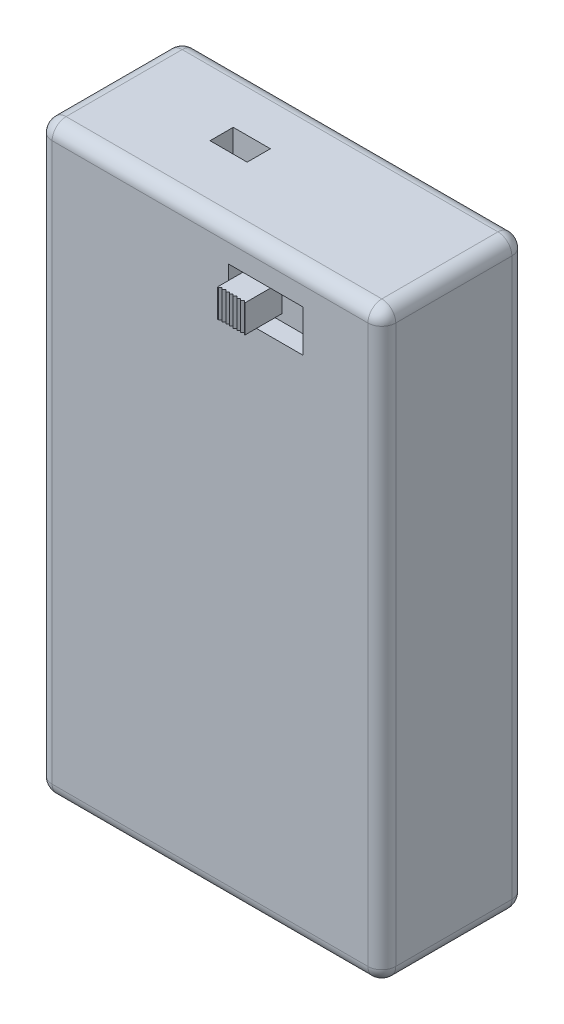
ISO-10303-21;
HEADER;
FILE_DESCRIPTION(('STEP AP214'),'2;1');
FILE_NAME('part.step','',(''),(''),'','','');
FILE_SCHEMA(('AUTOMOTIVE_DESIGN { 1 0 10303 214 1 1 1 1 }'));
ENDSEC;
DATA;
#1=APPLICATION_CONTEXT('core data for automotive mechanical design processes');
#2=APPLICATION_PROTOCOL_DEFINITION('international standard','automotive_design',2000,#1);
#3=PRODUCT_CONTEXT('',#1,'mechanical');
#4=PRODUCT('Part','Part','',(#3));
#5=PRODUCT_RELATED_PRODUCT_CATEGORY('part','',(#4));
#6=PRODUCT_DEFINITION_FORMATION('','',#4);
#7=PRODUCT_DEFINITION_CONTEXT('part definition',#1,'design');
#8=PRODUCT_DEFINITION('design','',#6,#7);
#9=PRODUCT_DEFINITION_SHAPE('','',#8);
#10=(LENGTH_UNIT() NAMED_UNIT(*) SI_UNIT(.MILLI.,.METRE.));
#11=(NAMED_UNIT(*) PLANE_ANGLE_UNIT() SI_UNIT($,.RADIAN.));
#12=(NAMED_UNIT(*) SI_UNIT($,.STERADIAN.) SOLID_ANGLE_UNIT());
#13=UNCERTAINTY_MEASURE_WITH_UNIT(LENGTH_MEASURE(1.E-05),#10,'distance_accuracy_value','');
#14=(GEOMETRIC_REPRESENTATION_CONTEXT(3) GLOBAL_UNCERTAINTY_ASSIGNED_CONTEXT((#13)) GLOBAL_UNIT_ASSIGNED_CONTEXT((#10,
#11,#12)) REPRESENTATION_CONTEXT('',''));
#15=CARTESIAN_POINT('',(0.,0.,0.));
#16=DIRECTION('',(0.,0.,1.));
#17=DIRECTION('',(1.,0.,0.));
#18=AXIS2_PLACEMENT_3D('',#15,#16,#17);
#19=CARTESIAN_POINT('',(21.2846397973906,55.75,17.5));
#20=DIRECTION('',(0.,1.,0.));
#21=DIRECTION('',(0.,0.,1.));
#22=AXIS2_PLACEMENT_3D('',#19,#20,#21);
#23=PLANE('',#22);
#24=DIRECTION('',(0.707106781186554,0.,0.707106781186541));
#25=VECTOR('',#24,1.);
#26=CARTESIAN_POINT('',(22.7403150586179,55.75,16.0443247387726));
#27=LINE('',#26,#25);
#28=CARTESIAN_POINT('',(23.9959903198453,55.75,17.3));
#29=VERTEX_POINT('',#28);
#30=CARTESIAN_POINT('',(24.1959903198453,55.75,17.5));
#31=VERTEX_POINT('',#30);
#32=EDGE_CURVE('E419',#29,#31,#27,.T.);
#33=ORIENTED_EDGE('',*,*,#32,.F.);
#34=DIRECTION('',(0.707106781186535,0.,-0.70710678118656));
#35=VECTOR('',#34,1.);
#36=CARTESIAN_POINT('',(22.540315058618,55.75,18.7556752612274));
#37=LINE('',#36,#35);
#38=CARTESIAN_POINT('',(23.7959903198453,55.75,17.5));
#39=VERTEX_POINT('',#38);
#40=EDGE_CURVE('E415',#39,#29,#37,.T.);
#41=ORIENTED_EDGE('',*,*,#40,.F.);
#42=DIRECTION('',(0.707106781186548,0.,0.707106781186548));
#43=VECTOR('',#42,1.);
#44=CARTESIAN_POINT('',(22.540315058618,55.75,16.2443247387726));
#45=LINE('',#44,#43);
#46=CARTESIAN_POINT('',(23.5959903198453,55.75,17.3));
#47=VERTEX_POINT('',#46);
#48=EDGE_CURVE('E411',#47,#39,#45,.T.);
#49=ORIENTED_EDGE('',*,*,#48,.F.);
#50=DIRECTION('',(0.707106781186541,0.,-0.707106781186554));
#51=VECTOR('',#50,1.);
#52=CARTESIAN_POINT('',(22.340315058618,55.75,18.5556752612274));
#53=LINE('',#52,#51);
#54=CARTESIAN_POINT('',(23.3959903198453,55.75,17.5));
#55=VERTEX_POINT('',#54);
#56=EDGE_CURVE('E407',#55,#47,#53,.T.);
#57=ORIENTED_EDGE('',*,*,#56,.F.);
#58=DIRECTION('',(0.707106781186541,0.,0.707106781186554));
#59=VECTOR('',#58,1.);
#60=CARTESIAN_POINT('',(22.340315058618,55.75,16.4443247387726));
#61=LINE('',#60,#59);
#62=CARTESIAN_POINT('',(23.1959903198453,55.75,17.3));
#63=VERTEX_POINT('',#62);
#64=EDGE_CURVE('E403',#63,#55,#61,.T.);
#65=ORIENTED_EDGE('',*,*,#64,.F.);
#66=DIRECTION('',(0.707106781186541,0.,-0.707106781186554));
#67=VECTOR('',#66,1.);
#68=CARTESIAN_POINT('',(22.140315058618,55.75,18.3556752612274));
#69=LINE('',#68,#67);
#70=CARTESIAN_POINT('',(22.9959903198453,55.75,17.5));
#71=VERTEX_POINT('',#70);
#72=EDGE_CURVE('E399',#71,#63,#69,.T.);
#73=ORIENTED_EDGE('',*,*,#72,.F.);
#74=DIRECTION('',(0.707106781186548,0.,0.707106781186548));
#75=VECTOR('',#74,1.);
#76=CARTESIAN_POINT('',(22.140315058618,55.75,16.6443247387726));
#77=LINE('',#76,#75);
#78=CARTESIAN_POINT('',(22.7959903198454,55.75,17.3));
#79=VERTEX_POINT('',#78);
#80=EDGE_CURVE('E395',#79,#71,#77,.T.);
#81=ORIENTED_EDGE('',*,*,#80,.F.);
#82=DIRECTION('',(0.707106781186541,0.,-0.707106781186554));
#83=VECTOR('',#82,1.);
#84=CARTESIAN_POINT('',(21.940315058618,55.75,18.1556752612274));
#85=LINE('',#84,#83);
#86=CARTESIAN_POINT('',(22.5959903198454,55.75,17.5));
#87=VERTEX_POINT('',#86);
#88=EDGE_CURVE('E391',#87,#79,#85,.T.);
#89=ORIENTED_EDGE('',*,*,#88,.F.);
#90=DIRECTION('',(0.70710678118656,0.,0.707106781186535));
#91=VECTOR('',#90,1.);
#92=CARTESIAN_POINT('',(21.940315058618,55.75,16.8443247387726));
#93=LINE('',#92,#91);
#94=CARTESIAN_POINT('',(22.3959903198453,55.75,17.3));
#95=VERTEX_POINT('',#94);
#96=EDGE_CURVE('E387',#95,#87,#93,.T.);
#97=ORIENTED_EDGE('',*,*,#96,.F.);
#98=DIRECTION('',(0.707106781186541,0.,-0.707106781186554));
#99=VECTOR('',#98,1.);
#100=CARTESIAN_POINT('',(21.740315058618,55.75,17.9556752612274));
#101=LINE('',#100,#99);
#102=CARTESIAN_POINT('',(22.1959903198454,55.75,17.5));
#103=VERTEX_POINT('',#102);
#104=EDGE_CURVE('E383',#103,#95,#101,.T.);
#105=ORIENTED_EDGE('',*,*,#104,.F.);
#106=DIRECTION('',(0.707106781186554,0.,0.707106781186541));
#107=VECTOR('',#106,1.);
#108=CARTESIAN_POINT('',(21.740315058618,55.75,17.0443247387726));
#109=LINE('',#108,#107);
#110=CARTESIAN_POINT('',(21.9959903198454,55.75,17.3));
#111=VERTEX_POINT('',#110);
#112=EDGE_CURVE('E379',#111,#103,#109,.T.);
#113=ORIENTED_EDGE('',*,*,#112,.F.);
#114=DIRECTION('',(0.707106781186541,0.,-0.707106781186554));
#115=VECTOR('',#114,1.);
#116=CARTESIAN_POINT('',(21.540315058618,55.75,17.7556752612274));
#117=LINE('',#116,#115);
#118=CARTESIAN_POINT('',(21.7959903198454,55.75,17.5));
#119=VERTEX_POINT('',#118);
#120=EDGE_CURVE('E375',#119,#111,#117,.T.);
#121=ORIENTED_EDGE('',*,*,#120,.F.);
#122=DIRECTION('',(0.707106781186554,0.,0.707106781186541));
#123=VECTOR('',#122,1.);
#124=CARTESIAN_POINT('',(21.540315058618,55.75,17.2443247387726));
#125=LINE('',#124,#123);
#126=CARTESIAN_POINT('',(21.5959903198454,55.75,17.3));
#127=VERTEX_POINT('',#126);
#128=EDGE_CURVE('E371',#127,#119,#125,.T.);
#129=ORIENTED_EDGE('',*,*,#128,.F.);
#130=DIRECTION('',(0.707106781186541,0.,-0.707106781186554));
#131=VECTOR('',#130,1.);
#132=CARTESIAN_POINT('',(21.340315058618,55.75,17.5556752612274));
#133=LINE('',#132,#131);
#134=CARTESIAN_POINT('',(21.3959903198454,55.75,17.5));
#135=VERTEX_POINT('',#134);
#136=EDGE_CURVE('E367',#135,#127,#133,.T.);
#137=ORIENTED_EDGE('',*,*,#136,.F.);
#138=DIRECTION('',(1.,0.,0.));
#139=VECTOR('',#138,1.);
#140=CARTESIAN_POINT('',(21.2846397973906,55.75,17.5));
#141=LINE('',#140,#139);
#142=CARTESIAN_POINT('',(21.2846397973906,55.75,17.5));
#143=VERTEX_POINT('',#142);
#144=EDGE_CURVE('E427',#143,#135,#141,.T.);
#145=ORIENTED_EDGE('',*,*,#144,.F.);
#146=DIRECTION('',(0.,0.,-1.));
#147=VECTOR('',#146,1.);
#148=CARTESIAN_POINT('',(21.2846397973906,55.75,17.5));
#149=LINE('',#148,#147);
#150=CARTESIAN_POINT('',(21.2846397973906,55.75,13.5));
#151=VERTEX_POINT('',#150);
#152=EDGE_CURVE('E452',#143,#151,#149,.T.);
#153=ORIENTED_EDGE('',*,*,#152,.T.);
#154=DIRECTION('',(1.,0.,0.));
#155=VECTOR('',#154,1.);
#156=CARTESIAN_POINT('',(21.2846397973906,55.75,13.5));
#157=LINE('',#156,#155);
#158=CARTESIAN_POINT('',(24.25,55.75,13.5));
#159=VERTEX_POINT('',#158);
#160=EDGE_CURVE('E439',#151,#159,#157,.T.);
#161=ORIENTED_EDGE('',*,*,#160,.T.);
#162=DIRECTION('',(0.,0.,-1.));
#163=VECTOR('',#162,1.);
#164=CARTESIAN_POINT('',(24.25,55.75,17.5));
#165=LINE('',#164,#163);
#166=CARTESIAN_POINT('',(24.25,55.75,17.5));
#167=VERTEX_POINT('',#166);
#168=EDGE_CURVE('E449',#167,#159,#165,.T.);
#169=ORIENTED_EDGE('',*,*,#168,.F.);
#170=EDGE_CURVE('E425',#31,#167,#141,.T.);
#171=ORIENTED_EDGE('',*,*,#170,.F.);
#172=EDGE_LOOP('',(#33,#41,#49,#57,#65,#73,#81,#89,#97,#105,#113,#121,#129,#137,#145,#153,#161,
#169,#171));
#173=FACE_BOUND('',#172,.T.);
#174=ADVANCED_FACE('F37',(#173),#23,.F.);
#175=CARTESIAN_POINT('',(21.2846397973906,58.75,17.5));
#176=DIRECTION('',(0.,-1.,0.));
#177=DIRECTION('',(0.,0.,-1.));
#178=AXIS2_PLACEMENT_3D('',#175,#176,#177);
#179=PLANE('',#178);
#180=DIRECTION('',(-0.707106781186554,0.,-0.707106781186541));
#181=VECTOR('',#180,1.);
#182=CARTESIAN_POINT('',(22.7403150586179,58.75,16.0443247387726));
#183=LINE('',#182,#181);
#184=CARTESIAN_POINT('',(24.1959903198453,58.75,17.5));
#185=VERTEX_POINT('',#184);
#186=CARTESIAN_POINT('',(23.9959903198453,58.75,17.3));
#187=VERTEX_POINT('',#186);
#188=EDGE_CURVE('E417',#185,#187,#183,.T.);
#189=ORIENTED_EDGE('',*,*,#188,.F.);
#190=DIRECTION('',(-1.,0.,0.));
#191=VECTOR('',#190,1.);
#192=CARTESIAN_POINT('',(21.2846397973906,58.75,17.5));
#193=LINE('',#192,#191);
#194=CARTESIAN_POINT('',(24.25,58.75,17.5));
#195=VERTEX_POINT('',#194);
#196=EDGE_CURVE('E433',#195,#185,#193,.T.);
#197=ORIENTED_EDGE('',*,*,#196,.F.);
#198=DIRECTION('',(0.,0.,-1.));
#199=VECTOR('',#198,1.);
#200=CARTESIAN_POINT('',(24.25,58.75,17.5));
#201=LINE('',#200,#199);
#202=CARTESIAN_POINT('',(24.25,58.75,13.5));
#203=VERTEX_POINT('',#202);
#204=EDGE_CURVE('E447',#195,#203,#201,.T.);
#205=ORIENTED_EDGE('',*,*,#204,.T.);
#206=DIRECTION('',(-1.,0.,0.));
#207=VECTOR('',#206,1.);
#208=CARTESIAN_POINT('',(21.2846397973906,58.75,13.5));
#209=LINE('',#208,#207);
#210=CARTESIAN_POINT('',(21.2846397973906,58.75,13.5));
#211=VERTEX_POINT('',#210);
#212=EDGE_CURVE('E426',#203,#211,#209,.T.);
#213=ORIENTED_EDGE('',*,*,#212,.T.);
#214=DIRECTION('',(0.,0.,-1.));
#215=VECTOR('',#214,1.);
#216=CARTESIAN_POINT('',(21.2846397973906,58.75,17.5));
#217=LINE('',#216,#215);
#218=CARTESIAN_POINT('',(21.2846397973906,58.75,17.5));
#219=VERTEX_POINT('',#218);
#220=EDGE_CURVE('E436',#219,#211,#217,.T.);
#221=ORIENTED_EDGE('',*,*,#220,.F.);
#222=CARTESIAN_POINT('',(21.3959903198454,58.75,17.5));
#223=VERTEX_POINT('',#222);
#224=EDGE_CURVE('E432',#223,#219,#193,.T.);
#225=ORIENTED_EDGE('',*,*,#224,.F.);
#226=DIRECTION('',(-0.707106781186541,0.,0.707106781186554));
#227=VECTOR('',#226,1.);
#228=CARTESIAN_POINT('',(21.340315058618,58.75,17.5556752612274));
#229=LINE('',#228,#227);
#230=CARTESIAN_POINT('',(21.5959903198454,58.75,17.3));
#231=VERTEX_POINT('',#230);
#232=EDGE_CURVE('E60',#231,#223,#229,.T.);
#233=ORIENTED_EDGE('',*,*,#232,.F.);
#234=DIRECTION('',(-0.707106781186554,0.,-0.707106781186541));
#235=VECTOR('',#234,1.);
#236=CARTESIAN_POINT('',(21.540315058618,58.75,17.2443247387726));
#237=LINE('',#236,#235);
#238=CARTESIAN_POINT('',(21.7959903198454,58.75,17.5));
#239=VERTEX_POINT('',#238);
#240=EDGE_CURVE('E369',#239,#231,#237,.T.);
#241=ORIENTED_EDGE('',*,*,#240,.F.);
#242=DIRECTION('',(-0.707106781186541,0.,0.707106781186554));
#243=VECTOR('',#242,1.);
#244=CARTESIAN_POINT('',(21.540315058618,58.75,17.7556752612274));
#245=LINE('',#244,#243);
#246=CARTESIAN_POINT('',(21.9959903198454,58.75,17.3));
#247=VERTEX_POINT('',#246);
#248=EDGE_CURVE('E373',#247,#239,#245,.T.);
#249=ORIENTED_EDGE('',*,*,#248,.F.);
#250=DIRECTION('',(-0.707106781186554,0.,-0.707106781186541));
#251=VECTOR('',#250,1.);
#252=CARTESIAN_POINT('',(21.740315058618,58.75,17.0443247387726));
#253=LINE('',#252,#251);
#254=CARTESIAN_POINT('',(22.1959903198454,58.75,17.5));
#255=VERTEX_POINT('',#254);
#256=EDGE_CURVE('E377',#255,#247,#253,.T.);
#257=ORIENTED_EDGE('',*,*,#256,.F.);
#258=DIRECTION('',(-0.707106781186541,0.,0.707106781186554));
#259=VECTOR('',#258,1.);
#260=CARTESIAN_POINT('',(21.740315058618,58.75,17.9556752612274));
#261=LINE('',#260,#259);
#262=CARTESIAN_POINT('',(22.3959903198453,58.75,17.3));
#263=VERTEX_POINT('',#262);
#264=EDGE_CURVE('E381',#263,#255,#261,.T.);
#265=ORIENTED_EDGE('',*,*,#264,.F.);
#266=DIRECTION('',(-0.70710678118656,0.,-0.707106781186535));
#267=VECTOR('',#266,1.);
#268=CARTESIAN_POINT('',(21.940315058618,58.75,16.8443247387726));
#269=LINE('',#268,#267);
#270=CARTESIAN_POINT('',(22.5959903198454,58.75,17.5));
#271=VERTEX_POINT('',#270);
#272=EDGE_CURVE('E385',#271,#263,#269,.T.);
#273=ORIENTED_EDGE('',*,*,#272,.F.);
#274=DIRECTION('',(-0.707106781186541,0.,0.707106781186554));
#275=VECTOR('',#274,1.);
#276=CARTESIAN_POINT('',(21.940315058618,58.75,18.1556752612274));
#277=LINE('',#276,#275);
#278=CARTESIAN_POINT('',(22.7959903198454,58.75,17.3));
#279=VERTEX_POINT('',#278);
#280=EDGE_CURVE('E389',#279,#271,#277,.T.);
#281=ORIENTED_EDGE('',*,*,#280,.F.);
#282=DIRECTION('',(-0.707106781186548,0.,-0.707106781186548));
#283=VECTOR('',#282,1.);
#284=CARTESIAN_POINT('',(22.140315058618,58.75,16.6443247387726));
#285=LINE('',#284,#283);
#286=CARTESIAN_POINT('',(22.9959903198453,58.75,17.5));
#287=VERTEX_POINT('',#286);
#288=EDGE_CURVE('E393',#287,#279,#285,.T.);
#289=ORIENTED_EDGE('',*,*,#288,.F.);
#290=DIRECTION('',(-0.707106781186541,0.,0.707106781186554));
#291=VECTOR('',#290,1.);
#292=CARTESIAN_POINT('',(22.140315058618,58.75,18.3556752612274));
#293=LINE('',#292,#291);
#294=CARTESIAN_POINT('',(23.1959903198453,58.75,17.3));
#295=VERTEX_POINT('',#294);
#296=EDGE_CURVE('E397',#295,#287,#293,.T.);
#297=ORIENTED_EDGE('',*,*,#296,.F.);
#298=DIRECTION('',(-0.707106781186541,0.,-0.707106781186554));
#299=VECTOR('',#298,1.);
#300=CARTESIAN_POINT('',(22.340315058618,58.75,16.4443247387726));
#301=LINE('',#300,#299);
#302=CARTESIAN_POINT('',(23.3959903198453,58.75,17.5));
#303=VERTEX_POINT('',#302);
#304=EDGE_CURVE('E401',#303,#295,#301,.T.);
#305=ORIENTED_EDGE('',*,*,#304,.F.);
#306=DIRECTION('',(-0.707106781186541,0.,0.707106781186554));
#307=VECTOR('',#306,1.);
#308=CARTESIAN_POINT('',(22.340315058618,58.75,18.5556752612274));
#309=LINE('',#308,#307);
#310=CARTESIAN_POINT('',(23.5959903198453,58.75,17.3));
#311=VERTEX_POINT('',#310);
#312=EDGE_CURVE('E405',#311,#303,#309,.T.);
#313=ORIENTED_EDGE('',*,*,#312,.F.);
#314=DIRECTION('',(-0.707106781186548,0.,-0.707106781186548));
#315=VECTOR('',#314,1.);
#316=CARTESIAN_POINT('',(22.540315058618,58.75,16.2443247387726));
#317=LINE('',#316,#315);
#318=CARTESIAN_POINT('',(23.7959903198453,58.75,17.5));
#319=VERTEX_POINT('',#318);
#320=EDGE_CURVE('E409',#319,#311,#317,.T.);
#321=ORIENTED_EDGE('',*,*,#320,.F.);
#322=DIRECTION('',(-0.707106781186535,0.,0.70710678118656));
#323=VECTOR('',#322,1.);
#324=CARTESIAN_POINT('',(22.540315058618,58.75,18.7556752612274));
#325=LINE('',#324,#323);
#326=EDGE_CURVE('E413',#187,#319,#325,.T.);
#327=ORIENTED_EDGE('',*,*,#326,.F.);
#328=EDGE_LOOP('',(#189,#197,#205,#213,#221,#225,#233,#241,#249,#257,#265,#273,#281,#289,#297,
#305,#313,#321,#327));
#329=FACE_BOUND('',#328,.T.);
#330=ADVANCED_FACE('F614',(#329),#179,.F.);
#331=CARTESIAN_POINT('',(0.,0.,17.5));
#332=DIRECTION('',(0.,0.,1.));
#333=DIRECTION('',(1.,0.,0.));
#334=AXIS2_PLACEMENT_3D('',#331,#332,#333);
#335=PLANE('',#334);
#336=ORIENTED_EDGE('',*,*,#196,.T.);
#337=DIRECTION('',(0.,-1.,0.));
#338=VECTOR('',#337,1.);
#339=CARTESIAN_POINT('',(24.1959903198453,0.,17.5));
#340=LINE('',#339,#338);
#341=EDGE_CURVE('E11',#185,#31,#340,.T.);
#342=ORIENTED_EDGE('',*,*,#341,.T.);
#343=ORIENTED_EDGE('',*,*,#170,.T.);
#344=DIRECTION('',(0.,1.,0.));
#345=VECTOR('',#344,1.);
#346=CARTESIAN_POINT('',(24.25,58.75,17.5));
#347=LINE('',#346,#345);
#348=EDGE_CURVE('E430',#167,#195,#347,.T.);
#349=ORIENTED_EDGE('',*,*,#348,.T.);
#350=EDGE_LOOP('',(#336,#342,#343,#349));
#351=FACE_BOUND('',#350,.T.);
#352=ADVANCED_FACE('F691',(#351),#335,.T.);
#353=ORIENTED_EDGE('',*,*,#144,.T.);
#354=DIRECTION('',(0.,1.,0.));
#355=VECTOR('',#354,1.);
#356=CARTESIAN_POINT('',(21.3959903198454,0.,17.5));
#357=LINE('',#356,#355);
#358=EDGE_CURVE('E45',#135,#223,#357,.T.);
#359=ORIENTED_EDGE('',*,*,#358,.T.);
#360=ORIENTED_EDGE('',*,*,#224,.T.);
#361=DIRECTION('',(0.,-1.,0.));
#362=VECTOR('',#361,1.);
#363=CARTESIAN_POINT('',(21.2846397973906,58.75,17.5));
#364=LINE('',#363,#362);
#365=EDGE_CURVE('E422',#219,#143,#364,.T.);
#366=ORIENTED_EDGE('',*,*,#365,.T.);
#367=EDGE_LOOP('',(#353,#359,#360,#366));
#368=FACE_BOUND('',#367,.T.);
#369=ADVANCED_FACE('F609',(#368),#335,.T.);
#370=CARTESIAN_POINT('',(0.,0.,13.5));
#371=DIRECTION('',(0.,0.,1.));
#372=DIRECTION('',(1.,0.,0.));
#373=AXIS2_PLACEMENT_3D('',#370,#371,#372);
#374=PLANE('',#373);
#375=DIRECTION('',(0.,-1.,0.));
#376=VECTOR('',#375,1.);
#377=CARTESIAN_POINT('',(20.5,59.5,13.5));
#378=LINE('',#377,#376);
#379=CARTESIAN_POINT('',(20.5,59.5,13.5));
#380=VERTEX_POINT('',#379);
#381=CARTESIAN_POINT('',(20.5,55.,13.5));
#382=VERTEX_POINT('',#381);
#383=EDGE_CURVE('E455',#380,#382,#378,.T.);
#384=ORIENTED_EDGE('',*,*,#383,.T.);
#385=DIRECTION('',(1.,0.,0.));
#386=VECTOR('',#385,1.);
#387=CARTESIAN_POINT('',(20.5,55.,13.5));
#388=LINE('',#387,#386);
#389=CARTESIAN_POINT('',(28.5,55.,13.5));
#390=VERTEX_POINT('',#389);
#391=EDGE_CURVE('E458',#382,#390,#388,.T.);
#392=ORIENTED_EDGE('',*,*,#391,.T.);
#393=DIRECTION('',(0.,1.,0.));
#394=VECTOR('',#393,1.);
#395=CARTESIAN_POINT('',(28.5,59.5,13.5));
#396=LINE('',#395,#394);
#397=CARTESIAN_POINT('',(28.5,59.5,13.5));
#398=VERTEX_POINT('',#397);
#399=EDGE_CURVE('E462',#390,#398,#396,.T.);
#400=ORIENTED_EDGE('',*,*,#399,.T.);
#401=DIRECTION('',(-1.,0.,0.));
#402=VECTOR('',#401,1.);
#403=CARTESIAN_POINT('',(20.5,59.5,13.5));
#404=LINE('',#403,#402);
#405=EDGE_CURVE('E465',#398,#380,#404,.T.);
#406=ORIENTED_EDGE('',*,*,#405,.T.);
#407=EDGE_LOOP('',(#384,#392,#400,#406));
#408=FACE_BOUND('',#407,.T.);
#409=ORIENTED_EDGE('',*,*,#160,.F.);
#410=DIRECTION('',(0.,-1.,0.));
#411=VECTOR('',#410,1.);
#412=CARTESIAN_POINT('',(21.2846397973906,58.75,13.5));
#413=LINE('',#412,#411);
#414=EDGE_CURVE('E421',#211,#151,#413,.T.);
#415=ORIENTED_EDGE('',*,*,#414,.F.);
#416=ORIENTED_EDGE('',*,*,#212,.F.);
#417=DIRECTION('',(0.,1.,0.));
#418=VECTOR('',#417,1.);
#419=CARTESIAN_POINT('',(24.25,58.75,13.5));
#420=LINE('',#419,#418);
#421=EDGE_CURVE('E441',#159,#203,#420,.T.);
#422=ORIENTED_EDGE('',*,*,#421,.F.);
#423=EDGE_LOOP('',(#409,#415,#416,#422));
#424=FACE_BOUND('',#423,.T.);
#425=ADVANCED_FACE('F698',(#408,#424),#374,.T.);
#426=CARTESIAN_POINT('',(0.,0.,15.5));
#427=DIRECTION('',(1.,0.,0.));
#428=DIRECTION('',(0.,0.,-1.));
#429=AXIS2_PLACEMENT_3D('',#426,#427,#428);
#430=PLANE('',#429);
#431=DIRECTION('',(0.,0.,-1.));
#432=VECTOR('',#431,1.);
#433=CARTESIAN_POINT('',(0.,61.5,15.5));
#434=LINE('',#433,#432);
#435=CARTESIAN_POINT('',(0.,61.5,14.));
#436=VERTEX_POINT('',#435);
#437=CARTESIAN_POINT('',(0.,61.5,1.5));
#438=VERTEX_POINT('',#437);
#439=EDGE_CURVE('E499',#436,#438,#434,.T.);
#440=ORIENTED_EDGE('',*,*,#439,.T.);
#441=DIRECTION('',(0.,-1.,0.));
#442=VECTOR('',#441,1.);
#443=CARTESIAN_POINT('',(0.,0.,1.5));
#444=LINE('',#443,#442);
#445=CARTESIAN_POINT('',(0.,1.5,1.5));
#446=VERTEX_POINT('',#445);
#447=EDGE_CURVE('E504',#438,#446,#444,.T.);
#448=ORIENTED_EDGE('',*,*,#447,.T.);
#449=DIRECTION('',(0.,0.,-1.));
#450=VECTOR('',#449,1.);
#451=CARTESIAN_POINT('',(0.,1.5,15.5));
#452=LINE('',#451,#450);
#453=CARTESIAN_POINT('',(0.,1.5,14.));
#454=VERTEX_POINT('',#453);
#455=EDGE_CURVE('E501',#446,#454,#452,.F.);
#456=ORIENTED_EDGE('',*,*,#455,.T.);
#457=DIRECTION('',(0.,-1.,0.));
#458=VECTOR('',#457,1.);
#459=CARTESIAN_POINT('',(0.,0.,14.));
#460=LINE('',#459,#458);
#461=EDGE_CURVE('E497',#454,#436,#460,.F.);
#462=ORIENTED_EDGE('',*,*,#461,.T.);
#463=EDGE_LOOP('',(#440,#448,#456,#462));
#464=FACE_BOUND('',#463,.T.);
#465=ADVANCED_FACE('F700',(#464),#430,.F.);
#466=CARTESIAN_POINT('',(0.,0.,15.5));
#467=DIRECTION('',(0.,1.,0.));
#468=DIRECTION('',(0.,0.,1.));
#469=AXIS2_PLACEMENT_3D('',#466,#467,#468);
#470=PLANE('',#469);
#471=DIRECTION('',(0.,0.,-1.));
#472=VECTOR('',#471,1.);
#473=CARTESIAN_POINT('',(1.5,0.,15.5));
#474=LINE('',#473,#472);
#475=CARTESIAN_POINT('',(1.5,0.,14.));
#476=VERTEX_POINT('',#475);
#477=CARTESIAN_POINT('',(1.5,0.,1.5));
#478=VERTEX_POINT('',#477);
#479=EDGE_CURVE('E492',#476,#478,#474,.T.);
#480=ORIENTED_EDGE('',*,*,#479,.T.);
#481=DIRECTION('',(1.,0.,0.));
#482=VECTOR('',#481,1.);
#483=CARTESIAN_POINT('',(37.,0.,1.5));
#484=LINE('',#483,#482);
#485=CARTESIAN_POINT('',(35.5,0.,1.5));
#486=VERTEX_POINT('',#485);
#487=EDGE_CURVE('E495',#478,#486,#484,.T.);
#488=ORIENTED_EDGE('',*,*,#487,.T.);
#489=DIRECTION('',(0.,0.,-1.));
#490=VECTOR('',#489,1.);
#491=CARTESIAN_POINT('',(35.5,0.,15.5));
#492=LINE('',#491,#490);
#493=CARTESIAN_POINT('',(35.5,0.,14.));
#494=VERTEX_POINT('',#493);
#495=EDGE_CURVE('E489',#486,#494,#492,.F.);
#496=ORIENTED_EDGE('',*,*,#495,.T.);
#497=DIRECTION('',(1.,0.,0.));
#498=VECTOR('',#497,1.);
#499=CARTESIAN_POINT('',(0.,0.,14.));
#500=LINE('',#499,#498);
#501=EDGE_CURVE('E487',#494,#476,#500,.F.);
#502=ORIENTED_EDGE('',*,*,#501,.T.);
#503=EDGE_LOOP('',(#480,#488,#496,#502));
#504=FACE_BOUND('',#503,.T.);
#505=ADVANCED_FACE('F707',(#504),#470,.F.);
#506=CARTESIAN_POINT('',(37.,0.,15.5));
#507=DIRECTION('',(-1.,0.,0.));
#508=DIRECTION('',(0.,0.,1.));
#509=AXIS2_PLACEMENT_3D('',#506,#507,#508);
#510=PLANE('',#509);
#511=DIRECTION('',(0.,0.,-1.));
#512=VECTOR('',#511,1.);
#513=CARTESIAN_POINT('',(37.,1.5,15.5));
#514=LINE('',#513,#512);
#515=CARTESIAN_POINT('',(37.,1.5,14.));
#516=VERTEX_POINT('',#515);
#517=CARTESIAN_POINT('',(37.,1.5,1.5));
#518=VERTEX_POINT('',#517);
#519=EDGE_CURVE('E510',#516,#518,#514,.T.);
#520=ORIENTED_EDGE('',*,*,#519,.T.);
#521=DIRECTION('',(0.,1.,0.));
#522=VECTOR('',#521,1.);
#523=CARTESIAN_POINT('',(37.,63.,1.5));
#524=LINE('',#523,#522);
#525=CARTESIAN_POINT('',(37.,61.5,1.5));
#526=VERTEX_POINT('',#525);
#527=EDGE_CURVE('E513',#518,#526,#524,.T.);
#528=ORIENTED_EDGE('',*,*,#527,.T.);
#529=DIRECTION('',(0.,0.,-1.));
#530=VECTOR('',#529,1.);
#531=CARTESIAN_POINT('',(37.,61.5,15.5));
#532=LINE('',#531,#530);
#533=CARTESIAN_POINT('',(37.,61.5,14.));
#534=VERTEX_POINT('',#533);
#535=EDGE_CURVE('E508',#526,#534,#532,.F.);
#536=ORIENTED_EDGE('',*,*,#535,.T.);
#537=DIRECTION('',(0.,1.,0.));
#538=VECTOR('',#537,1.);
#539=CARTESIAN_POINT('',(37.,0.,14.));
#540=LINE('',#539,#538);
#541=EDGE_CURVE('E506',#534,#516,#540,.F.);
#542=ORIENTED_EDGE('',*,*,#541,.T.);
#543=EDGE_LOOP('',(#520,#528,#536,#542));
#544=FACE_BOUND('',#543,.T.);
#545=ADVANCED_FACE('F752',(#544),#510,.F.);
#546=CARTESIAN_POINT('',(0.,63.,15.5));
#547=DIRECTION('',(0.,-1.,0.));
#548=DIRECTION('',(0.,0.,-1.));
#549=AXIS2_PLACEMENT_3D('',#546,#547,#548);
#550=PLANE('',#549);
#551=DIRECTION('',(1.,0.,0.));
#552=VECTOR('',#551,1.);
#553=CARTESIAN_POINT('',(11.5,63.,8.5));
#554=LINE('',#553,#552);
#555=CARTESIAN_POINT('',(11.5,63.,8.5));
#556=VERTEX_POINT('',#555);
#557=CARTESIAN_POINT('',(15.5,63.,8.5));
#558=VERTEX_POINT('',#557);
#559=EDGE_CURVE('E318',#556,#558,#554,.T.);
#560=ORIENTED_EDGE('',*,*,#559,.F.);
#561=DIRECTION('',(0.,0.,1.));
#562=VECTOR('',#561,1.);
#563=CARTESIAN_POINT('',(11.5,63.,6.));
#564=LINE('',#563,#562);
#565=CARTESIAN_POINT('',(11.5,63.,6.));
#566=VERTEX_POINT('',#565);
#567=EDGE_CURVE('E52',#566,#556,#564,.T.);
#568=ORIENTED_EDGE('',*,*,#567,.F.);
#569=DIRECTION('',(-1.,0.,0.));
#570=VECTOR('',#569,1.);
#571=CARTESIAN_POINT('',(11.5,63.,6.));
#572=LINE('',#571,#570);
#573=CARTESIAN_POINT('',(15.5,63.,6.));
#574=VERTEX_POINT('',#573);
#575=EDGE_CURVE('E309',#574,#566,#572,.T.);
#576=ORIENTED_EDGE('',*,*,#575,.F.);
#577=DIRECTION('',(0.,0.,-1.));
#578=VECTOR('',#577,1.);
#579=CARTESIAN_POINT('',(15.5,63.,6.));
#580=LINE('',#579,#578);
#581=EDGE_CURVE('E312',#558,#574,#580,.T.);
#582=ORIENTED_EDGE('',*,*,#581,.F.);
#583=EDGE_LOOP('',(#560,#568,#576,#582));
#584=FACE_BOUND('',#583,.T.);
#585=DIRECTION('',(0.,0.,-1.));
#586=VECTOR('',#585,1.);
#587=CARTESIAN_POINT('',(35.5,63.,15.5));
#588=LINE('',#587,#586);
#589=CARTESIAN_POINT('',(35.5,63.,14.));
#590=VERTEX_POINT('',#589);
#591=CARTESIAN_POINT('',(35.5,63.,1.5));
#592=VERTEX_POINT('',#591);
#593=EDGE_CURVE('E519',#590,#592,#588,.T.);
#594=ORIENTED_EDGE('',*,*,#593,.T.);
#595=DIRECTION('',(-1.,0.,0.));
#596=VECTOR('',#595,1.);
#597=CARTESIAN_POINT('',(0.,63.,1.5));
#598=LINE('',#597,#596);
#599=CARTESIAN_POINT('',(1.5,63.,1.5));
#600=VERTEX_POINT('',#599);
#601=EDGE_CURVE('E522',#592,#600,#598,.T.);
#602=ORIENTED_EDGE('',*,*,#601,.T.);
#603=DIRECTION('',(0.,0.,-1.));
#604=VECTOR('',#603,1.);
#605=CARTESIAN_POINT('',(1.5,63.,15.5));
#606=LINE('',#605,#604);
#607=CARTESIAN_POINT('',(1.5,63.,14.));
#608=VERTEX_POINT('',#607);
#609=EDGE_CURVE('E517',#600,#608,#606,.F.);
#610=ORIENTED_EDGE('',*,*,#609,.T.);
#611=DIRECTION('',(-1.,0.,0.));
#612=VECTOR('',#611,1.);
#613=CARTESIAN_POINT('',(0.,63.,14.));
#614=LINE('',#613,#612);
#615=EDGE_CURVE('E515',#608,#590,#614,.F.);
#616=ORIENTED_EDGE('',*,*,#615,.T.);
#617=EDGE_LOOP('',(#594,#602,#610,#616));
#618=FACE_BOUND('',#617,.T.);
#619=ADVANCED_FACE('F745',(#584,#618),#550,.F.);
#620=CARTESIAN_POINT('',(0.,0.,15.5));
#621=DIRECTION('',(0.,0.,-1.));
#622=DIRECTION('',(-1.,0.,0.));
#623=AXIS2_PLACEMENT_3D('',#620,#621,#622);
#624=PLANE('',#623);
#625=DIRECTION('',(1.,0.,0.));
#626=VECTOR('',#625,1.);
#627=CARTESIAN_POINT('',(20.5,55.,15.5));
#628=LINE('',#627,#626);
#629=CARTESIAN_POINT('',(20.5,55.,15.5));
#630=VERTEX_POINT('',#629);
#631=CARTESIAN_POINT('',(28.5,55.,15.5));
#632=VERTEX_POINT('',#631);
#633=EDGE_CURVE('E470',#630,#632,#628,.T.);
#634=ORIENTED_EDGE('',*,*,#633,.F.);
#635=DIRECTION('',(0.,-1.,0.));
#636=VECTOR('',#635,1.);
#637=CARTESIAN_POINT('',(20.5,59.5,15.5));
#638=LINE('',#637,#636);
#639=CARTESIAN_POINT('',(20.5,59.5,15.5));
#640=VERTEX_POINT('',#639);
#641=EDGE_CURVE('E454',#640,#630,#638,.T.);
#642=ORIENTED_EDGE('',*,*,#641,.F.);
#643=DIRECTION('',(-1.,0.,0.));
#644=VECTOR('',#643,1.);
#645=CARTESIAN_POINT('',(20.5,59.5,15.5));
#646=LINE('',#645,#644);
#647=CARTESIAN_POINT('',(28.5,59.5,15.5));
#648=VERTEX_POINT('',#647);
#649=EDGE_CURVE('E459',#648,#640,#646,.T.);
#650=ORIENTED_EDGE('',*,*,#649,.F.);
#651=DIRECTION('',(0.,1.,0.));
#652=VECTOR('',#651,1.);
#653=CARTESIAN_POINT('',(28.5,59.5,15.5));
#654=LINE('',#653,#652);
#655=EDGE_CURVE('E473',#632,#648,#654,.T.);
#656=ORIENTED_EDGE('',*,*,#655,.F.);
#657=EDGE_LOOP('',(#634,#642,#650,#656));
#658=FACE_BOUND('',#657,.T.);
#659=DIRECTION('',(0.,1.,0.));
#660=VECTOR('',#659,1.);
#661=CARTESIAN_POINT('',(35.5,0.,15.5));
#662=LINE('',#661,#660);
#663=CARTESIAN_POINT('',(35.5,1.5,15.5));
#664=VERTEX_POINT('',#663);
#665=CARTESIAN_POINT('',(35.5,61.5,15.5));
#666=VERTEX_POINT('',#665);
#667=EDGE_CURVE('E537',#664,#666,#662,.T.);
#668=ORIENTED_EDGE('',*,*,#667,.T.);
#669=DIRECTION('',(-1.,0.,0.));
#670=VECTOR('',#669,1.);
#671=CARTESIAN_POINT('',(0.,61.5,15.5));
#672=LINE('',#671,#670);
#673=CARTESIAN_POINT('',(1.5,61.5,15.5));
#674=VERTEX_POINT('',#673);
#675=EDGE_CURVE('E539',#666,#674,#672,.T.);
#676=ORIENTED_EDGE('',*,*,#675,.T.);
#677=DIRECTION('',(0.,-1.,0.));
#678=VECTOR('',#677,1.);
#679=CARTESIAN_POINT('',(1.5,0.,15.5));
#680=LINE('',#679,#678);
#681=CARTESIAN_POINT('',(1.5,1.5,15.5));
#682=VERTEX_POINT('',#681);
#683=EDGE_CURVE('E533',#674,#682,#680,.T.);
#684=ORIENTED_EDGE('',*,*,#683,.T.);
#685=DIRECTION('',(1.,0.,0.));
#686=VECTOR('',#685,1.);
#687=CARTESIAN_POINT('',(0.,1.5,15.5));
#688=LINE('',#687,#686);
#689=EDGE_CURVE('E535',#682,#664,#688,.T.);
#690=ORIENTED_EDGE('',*,*,#689,.T.);
#691=EDGE_LOOP('',(#668,#676,#684,#690));
#692=FACE_BOUND('',#691,.T.);
#693=ADVANCED_FACE('F741',(#658,#692),#624,.F.);
#694=CARTESIAN_POINT('',(0.,0.,0.));
#695=DIRECTION('',(0.,0.,-1.));
#696=DIRECTION('',(-1.,0.,0.));
#697=AXIS2_PLACEMENT_3D('',#694,#695,#696);
#698=PLANE('',#697);
#699=DIRECTION('',(0.,1.,0.));
#700=VECTOR('',#699,1.);
#701=CARTESIAN_POINT('',(35.5,0.,0.));
#702=LINE('',#701,#700);
#703=CARTESIAN_POINT('',(35.5,61.5,0.));
#704=VERTEX_POINT('',#703);
#705=CARTESIAN_POINT('',(35.5,1.5,0.));
#706=VERTEX_POINT('',#705);
#707=EDGE_CURVE('E528',#704,#706,#702,.F.);
#708=ORIENTED_EDGE('',*,*,#707,.T.);
#709=DIRECTION('',(1.,0.,0.));
#710=VECTOR('',#709,1.);
#711=CARTESIAN_POINT('',(0.,1.5,0.));
#712=LINE('',#711,#710);
#713=CARTESIAN_POINT('',(1.5,1.5,0.));
#714=VERTEX_POINT('',#713);
#715=EDGE_CURVE('E530',#706,#714,#712,.F.);
#716=ORIENTED_EDGE('',*,*,#715,.T.);
#717=DIRECTION('',(0.,-1.,0.));
#718=VECTOR('',#717,1.);
#719=CARTESIAN_POINT('',(1.5,63.,0.));
#720=LINE('',#719,#718);
#721=CARTESIAN_POINT('',(1.5,61.5,0.));
#722=VERTEX_POINT('',#721);
#723=EDGE_CURVE('E524',#714,#722,#720,.F.);
#724=ORIENTED_EDGE('',*,*,#723,.T.);
#725=DIRECTION('',(-1.,0.,0.));
#726=VECTOR('',#725,1.);
#727=CARTESIAN_POINT('',(37.,61.5,0.));
#728=LINE('',#727,#726);
#729=EDGE_CURVE('E526',#722,#704,#728,.F.);
#730=ORIENTED_EDGE('',*,*,#729,.T.);
#731=EDGE_LOOP('',(#708,#716,#724,#730));
#732=FACE_BOUND('',#731,.T.);
#733=ADVANCED_FACE('F744',(#732),#698,.T.);
#734=CARTESIAN_POINT('',(35.5,61.5,15.5));
#735=DIRECTION('',(0.,0.,-1.));
#736=DIRECTION('',(-1.,0.,0.));
#737=AXIS2_PLACEMENT_3D('',#734,#735,#736);
#738=CYLINDRICAL_SURFACE('',#737,1.5);
#739=CARTESIAN_POINT('',(35.5,61.5,14.));
#740=DIRECTION('',(0.,0.,1.));
#741=DIRECTION('',(1.,0.,0.));
#742=AXIS2_PLACEMENT_3D('',#739,#740,#741);
#743=CIRCLE('',#742,1.5);
#744=EDGE_CURVE('E490',#534,#590,#743,.T.);
#745=ORIENTED_EDGE('',*,*,#744,.F.);
#746=ORIENTED_EDGE('',*,*,#535,.F.);
#747=CARTESIAN_POINT('',(35.5,61.5,1.5));
#748=DIRECTION('',(0.,0.,-1.));
#749=DIRECTION('',(-1.,0.,0.));
#750=AXIS2_PLACEMENT_3D('',#747,#748,#749);
#751=CIRCLE('',#750,1.5);
#752=EDGE_CURVE('E603',#592,#526,#751,.T.);
#753=ORIENTED_EDGE('',*,*,#752,.F.);
#754=ORIENTED_EDGE('',*,*,#593,.F.);
#755=EDGE_LOOP('',(#745,#746,#753,#754));
#756=FACE_BOUND('',#755,.T.);
#757=ADVANCED_FACE('F39',(#756),#738,.T.);
#758=CARTESIAN_POINT('',(35.5,61.5,14.));
#759=DIRECTION('',(0.,0.,1.));
#760=DIRECTION('',(1.,0.,0.));
#761=AXIS2_PLACEMENT_3D('',#758,#759,#760);
#762=SPHERICAL_SURFACE('',#761,1.5);
#763=CARTESIAN_POINT('',(35.5,61.5,14.));
#764=DIRECTION('',(0.,1.,0.));
#765=DIRECTION('',(0.,0.,1.));
#766=AXIS2_PLACEMENT_3D('',#763,#764,#765);
#767=CIRCLE('',#766,1.5);
#768=EDGE_CURVE('E597',#534,#666,#767,.F.);
#769=ORIENTED_EDGE('',*,*,#768,.F.);
#770=ORIENTED_EDGE('',*,*,#744,.T.);
#771=CARTESIAN_POINT('',(35.5,61.5,14.));
#772=DIRECTION('',(1.,0.,0.));
#773=DIRECTION('',(0.,0.,-1.));
#774=AXIS2_PLACEMENT_3D('',#771,#772,#773);
#775=CIRCLE('',#774,1.5);
#776=EDGE_CURVE('E600',#666,#590,#775,.F.);
#777=ORIENTED_EDGE('',*,*,#776,.F.);
#778=EDGE_LOOP('',(#769,#770,#777));
#779=FACE_BOUND('',#778,.T.);
#780=ADVANCED_FACE('F829',(#779),#762,.T.);
#781=CARTESIAN_POINT('',(35.5,61.5,1.5));
#782=DIRECTION('',(0.,0.,1.));
#783=DIRECTION('',(1.,0.,0.));
#784=AXIS2_PLACEMENT_3D('',#781,#782,#783);
#785=SPHERICAL_SURFACE('',#784,1.5);
#786=CARTESIAN_POINT('',(35.5,61.5,1.5));
#787=DIRECTION('',(1.,0.,0.));
#788=DIRECTION('',(0.,0.,-1.));
#789=AXIS2_PLACEMENT_3D('',#786,#787,#788);
#790=CIRCLE('',#789,1.5);
#791=EDGE_CURVE('E591',#592,#704,#790,.F.);
#792=ORIENTED_EDGE('',*,*,#791,.F.);
#793=ORIENTED_EDGE('',*,*,#752,.T.);
#794=CARTESIAN_POINT('',(35.5,61.5,1.5));
#795=DIRECTION('',(0.,1.,0.));
#796=DIRECTION('',(0.,0.,1.));
#797=AXIS2_PLACEMENT_3D('',#794,#795,#796);
#798=CIRCLE('',#797,1.5);
#799=EDGE_CURVE('E594',#704,#526,#798,.F.);
#800=ORIENTED_EDGE('',*,*,#799,.F.);
#801=EDGE_LOOP('',(#792,#793,#800));
#802=FACE_BOUND('',#801,.T.);
#803=ADVANCED_FACE('F826',(#802),#785,.T.);
#804=CARTESIAN_POINT('',(0.,61.5,14.));
#805=DIRECTION('',(-1.,0.,0.));
#806=DIRECTION('',(0.,0.,1.));
#807=AXIS2_PLACEMENT_3D('',#804,#805,#806);
#808=CYLINDRICAL_SURFACE('',#807,1.5);
#809=ORIENTED_EDGE('',*,*,#776,.T.);
#810=ORIENTED_EDGE('',*,*,#615,.F.);
#811=CARTESIAN_POINT('',(1.5,61.5,14.));
#812=DIRECTION('',(-1.,0.,0.));
#813=DIRECTION('',(0.,0.,1.));
#814=AXIS2_PLACEMENT_3D('',#811,#812,#813);
#815=CIRCLE('',#814,1.5);
#816=EDGE_CURVE('E585',#674,#608,#815,.T.);
#817=ORIENTED_EDGE('',*,*,#816,.F.);
#818=ORIENTED_EDGE('',*,*,#675,.F.);
#819=EDGE_LOOP('',(#809,#810,#817,#818));
#820=FACE_BOUND('',#819,.T.);
#821=ADVANCED_FACE('F822',(#820),#808,.T.);
#822=CARTESIAN_POINT('',(35.5,0.,14.));
#823=DIRECTION('',(0.,1.,0.));
#824=DIRECTION('',(0.,0.,1.));
#825=AXIS2_PLACEMENT_3D('',#822,#823,#824);
#826=CYLINDRICAL_SURFACE('',#825,1.5);
#827=ORIENTED_EDGE('',*,*,#768,.T.);
#828=ORIENTED_EDGE('',*,*,#667,.F.);
#829=CARTESIAN_POINT('',(35.5,1.5,14.));
#830=DIRECTION('',(0.,-1.,0.));
#831=DIRECTION('',(0.,0.,-1.));
#832=AXIS2_PLACEMENT_3D('',#829,#830,#831);
#833=CIRCLE('',#832,1.5);
#834=EDGE_CURVE('E582',#516,#664,#833,.T.);
#835=ORIENTED_EDGE('',*,*,#834,.F.);
#836=ORIENTED_EDGE('',*,*,#541,.F.);
#837=EDGE_LOOP('',(#827,#828,#835,#836));
#838=FACE_BOUND('',#837,.T.);
#839=ADVANCED_FACE('F818',(#838),#826,.T.);
#840=CARTESIAN_POINT('',(35.5,1.5,15.5));
#841=DIRECTION('',(0.,0.,-1.));
#842=DIRECTION('',(-1.,0.,0.));
#843=AXIS2_PLACEMENT_3D('',#840,#841,#842);
#844=CYLINDRICAL_SURFACE('',#843,1.5);
#845=CARTESIAN_POINT('',(35.5,1.5,1.5));
#846=DIRECTION('',(0.,0.,-1.));
#847=DIRECTION('',(-1.,0.,0.));
#848=AXIS2_PLACEMENT_3D('',#845,#846,#847);
#849=CIRCLE('',#848,1.5);
#850=EDGE_CURVE('E576',#518,#486,#849,.T.);
#851=ORIENTED_EDGE('',*,*,#850,.F.);
#852=ORIENTED_EDGE('',*,*,#519,.F.);
#853=CARTESIAN_POINT('',(35.5,1.5,14.));
#854=DIRECTION('',(0.,0.,1.));
#855=DIRECTION('',(1.,0.,0.));
#856=AXIS2_PLACEMENT_3D('',#853,#854,#855);
#857=CIRCLE('',#856,1.5);
#858=EDGE_CURVE('E579',#494,#516,#857,.T.);
#859=ORIENTED_EDGE('',*,*,#858,.F.);
#860=ORIENTED_EDGE('',*,*,#495,.F.);
#861=EDGE_LOOP('',(#851,#852,#859,#860));
#862=FACE_BOUND('',#861,.T.);
#863=ADVANCED_FACE('F814',(#862),#844,.T.);
#864=CARTESIAN_POINT('',(35.5,0.,1.5));
#865=DIRECTION('',(0.,-1.,0.));
#866=DIRECTION('',(0.,0.,-1.));
#867=AXIS2_PLACEMENT_3D('',#864,#865,#866);
#868=CYLINDRICAL_SURFACE('',#867,1.5);
#869=ORIENTED_EDGE('',*,*,#799,.T.);
#870=ORIENTED_EDGE('',*,*,#527,.F.);
#871=CARTESIAN_POINT('',(35.5,1.5,1.5));
#872=DIRECTION('',(0.,-1.,0.));
#873=DIRECTION('',(0.,0.,-1.));
#874=AXIS2_PLACEMENT_3D('',#871,#872,#873);
#875=CIRCLE('',#874,1.5);
#876=EDGE_CURVE('E574',#706,#518,#875,.T.);
#877=ORIENTED_EDGE('',*,*,#876,.F.);
#878=ORIENTED_EDGE('',*,*,#707,.F.);
#879=EDGE_LOOP('',(#869,#870,#877,#878));
#880=FACE_BOUND('',#879,.T.);
#881=ADVANCED_FACE('F810',(#880),#868,.T.);
#882=CARTESIAN_POINT('',(0.,61.5,1.5));
#883=DIRECTION('',(1.,0.,0.));
#884=DIRECTION('',(0.,0.,-1.));
#885=AXIS2_PLACEMENT_3D('',#882,#883,#884);
#886=CYLINDRICAL_SURFACE('',#885,1.5);
#887=ORIENTED_EDGE('',*,*,#791,.T.);
#888=ORIENTED_EDGE('',*,*,#729,.F.);
#889=CARTESIAN_POINT('',(1.5,61.5,1.5));
#890=DIRECTION('',(-1.,0.,0.));
#891=DIRECTION('',(0.,0.,1.));
#892=AXIS2_PLACEMENT_3D('',#889,#890,#891);
#893=CIRCLE('',#892,1.5);
#894=EDGE_CURVE('E571',#600,#722,#893,.T.);
#895=ORIENTED_EDGE('',*,*,#894,.F.);
#896=ORIENTED_EDGE('',*,*,#601,.F.);
#897=EDGE_LOOP('',(#887,#888,#895,#896));
#898=FACE_BOUND('',#897,.T.);
#899=ADVANCED_FACE('F806',(#898),#886,.T.);
#900=CARTESIAN_POINT('',(1.5,61.5,15.5));
#901=DIRECTION('',(0.,0.,-1.));
#902=DIRECTION('',(-1.,0.,0.));
#903=AXIS2_PLACEMENT_3D('',#900,#901,#902);
#904=CYLINDRICAL_SURFACE('',#903,1.5);
#905=CARTESIAN_POINT('',(1.5,61.5,14.));
#906=DIRECTION('',(0.,0.,1.));
#907=DIRECTION('',(1.,0.,0.));
#908=AXIS2_PLACEMENT_3D('',#905,#906,#907);
#909=CIRCLE('',#908,1.5);
#910=EDGE_CURVE('E588',#608,#436,#909,.T.);
#911=ORIENTED_EDGE('',*,*,#910,.F.);
#912=ORIENTED_EDGE('',*,*,#609,.F.);
#913=CARTESIAN_POINT('',(1.5,61.5,1.5));
#914=DIRECTION('',(0.,0.,-1.));
#915=DIRECTION('',(-1.,0.,0.));
#916=AXIS2_PLACEMENT_3D('',#913,#914,#915);
#917=CIRCLE('',#916,1.5);
#918=EDGE_CURVE('E568',#438,#600,#917,.T.);
#919=ORIENTED_EDGE('',*,*,#918,.F.);
#920=ORIENTED_EDGE('',*,*,#439,.F.);
#921=EDGE_LOOP('',(#911,#912,#919,#920));
#922=FACE_BOUND('',#921,.T.);
#923=ADVANCED_FACE('F802',(#922),#904,.T.);
#924=CARTESIAN_POINT('',(1.5,61.5,14.));
#925=DIRECTION('',(0.,0.,1.));
#926=DIRECTION('',(1.,0.,0.));
#927=AXIS2_PLACEMENT_3D('',#924,#925,#926);
#928=SPHERICAL_SURFACE('',#927,1.5);
#929=ORIENTED_EDGE('',*,*,#816,.T.);
#930=ORIENTED_EDGE('',*,*,#910,.T.);
#931=CARTESIAN_POINT('',(1.5,61.5,14.));
#932=DIRECTION('',(0.,1.,0.));
#933=DIRECTION('',(0.,0.,1.));
#934=AXIS2_PLACEMENT_3D('',#931,#932,#933);
#935=CIRCLE('',#934,1.5);
#936=EDGE_CURVE('E565',#674,#436,#935,.F.);
#937=ORIENTED_EDGE('',*,*,#936,.F.);
#938=EDGE_LOOP('',(#929,#930,#937));
#939=FACE_BOUND('',#938,.T.);
#940=ADVANCED_FACE('F798',(#939),#928,.T.);
#941=CARTESIAN_POINT('',(35.5,1.5,14.));
#942=DIRECTION('',(0.,0.,1.));
#943=DIRECTION('',(1.,0.,0.));
#944=AXIS2_PLACEMENT_3D('',#941,#942,#943);
#945=SPHERICAL_SURFACE('',#944,1.5);
#946=ORIENTED_EDGE('',*,*,#858,.T.);
#947=ORIENTED_EDGE('',*,*,#834,.T.);
#948=CARTESIAN_POINT('',(35.5,1.5,14.));
#949=DIRECTION('',(1.,0.,0.));
#950=DIRECTION('',(0.,0.,-1.));
#951=AXIS2_PLACEMENT_3D('',#948,#949,#950);
#952=CIRCLE('',#951,1.5);
#953=EDGE_CURVE('E562',#494,#664,#952,.F.);
#954=ORIENTED_EDGE('',*,*,#953,.F.);
#955=EDGE_LOOP('',(#946,#947,#954));
#956=FACE_BOUND('',#955,.T.);
#957=ADVANCED_FACE('F794',(#956),#945,.T.);
#958=CARTESIAN_POINT('',(35.5,1.5,1.5));
#959=DIRECTION('',(0.,0.,1.));
#960=DIRECTION('',(1.,0.,0.));
#961=AXIS2_PLACEMENT_3D('',#958,#959,#960);
#962=SPHERICAL_SURFACE('',#961,1.5);
#963=ORIENTED_EDGE('',*,*,#876,.T.);
#964=ORIENTED_EDGE('',*,*,#850,.T.);
#965=CARTESIAN_POINT('',(35.5,1.5,1.5));
#966=DIRECTION('',(1.,0.,0.));
#967=DIRECTION('',(0.,0.,-1.));
#968=AXIS2_PLACEMENT_3D('',#965,#966,#967);
#969=CIRCLE('',#968,1.5);
#970=EDGE_CURVE('E559',#706,#486,#969,.F.);
#971=ORIENTED_EDGE('',*,*,#970,.F.);
#972=EDGE_LOOP('',(#963,#964,#971));
#973=FACE_BOUND('',#972,.T.);
#974=ADVANCED_FACE('F790',(#973),#962,.T.);
#975=CARTESIAN_POINT('',(1.5,61.5,1.5));
#976=DIRECTION('',(0.,0.,1.));
#977=DIRECTION('',(1.,0.,0.));
#978=AXIS2_PLACEMENT_3D('',#975,#976,#977);
#979=SPHERICAL_SURFACE('',#978,1.5);
#980=ORIENTED_EDGE('',*,*,#918,.T.);
#981=ORIENTED_EDGE('',*,*,#894,.T.);
#982=CARTESIAN_POINT('',(1.5,61.5,1.5));
#983=DIRECTION('',(0.,1.,0.));
#984=DIRECTION('',(0.,0.,1.));
#985=AXIS2_PLACEMENT_3D('',#982,#983,#984);
#986=CIRCLE('',#985,1.5);
#987=EDGE_CURVE('E556',#438,#722,#986,.F.);
#988=ORIENTED_EDGE('',*,*,#987,.F.);
#989=EDGE_LOOP('',(#980,#981,#988));
#990=FACE_BOUND('',#989,.T.);
#991=ADVANCED_FACE('F786',(#990),#979,.T.);
#992=CARTESIAN_POINT('',(1.5,0.,14.));
#993=DIRECTION('',(0.,-1.,0.));
#994=DIRECTION('',(0.,0.,-1.));
#995=AXIS2_PLACEMENT_3D('',#992,#993,#994);
#996=CYLINDRICAL_SURFACE('',#995,1.5);
#997=ORIENTED_EDGE('',*,*,#936,.T.);
#998=ORIENTED_EDGE('',*,*,#461,.F.);
#999=CARTESIAN_POINT('',(1.5,1.5,14.));
#1000=DIRECTION('',(0.,-1.,0.));
#1001=DIRECTION('',(0.,0.,-1.));
#1002=AXIS2_PLACEMENT_3D('',#999,#1000,#1001);
#1003=CIRCLE('',#1002,1.5);
#1004=EDGE_CURVE('E553',#682,#454,#1003,.T.);
#1005=ORIENTED_EDGE('',*,*,#1004,.F.);
#1006=ORIENTED_EDGE('',*,*,#683,.F.);
#1007=EDGE_LOOP('',(#997,#998,#1005,#1006));
#1008=FACE_BOUND('',#1007,.T.);
#1009=ADVANCED_FACE('F782',(#1008),#996,.T.);
#1010=CARTESIAN_POINT('',(0.,1.5,14.));
#1011=DIRECTION('',(1.,0.,0.));
#1012=DIRECTION('',(0.,0.,-1.));
#1013=AXIS2_PLACEMENT_3D('',#1010,#1011,#1012);
#1014=CYLINDRICAL_SURFACE('',#1013,1.5);
#1015=ORIENTED_EDGE('',*,*,#953,.T.);
#1016=ORIENTED_EDGE('',*,*,#689,.F.);
#1017=CARTESIAN_POINT('',(1.5,1.5,14.));
#1018=DIRECTION('',(-1.,0.,0.));
#1019=DIRECTION('',(0.,0.,1.));
#1020=AXIS2_PLACEMENT_3D('',#1017,#1018,#1019);
#1021=CIRCLE('',#1020,1.5);
#1022=EDGE_CURVE('E550',#476,#682,#1021,.T.);
#1023=ORIENTED_EDGE('',*,*,#1022,.F.);
#1024=ORIENTED_EDGE('',*,*,#501,.F.);
#1025=EDGE_LOOP('',(#1015,#1016,#1023,#1024));
#1026=FACE_BOUND('',#1025,.T.);
#1027=ADVANCED_FACE('F778',(#1026),#1014,.T.);
#1028=CARTESIAN_POINT('',(0.,1.5,1.5));
#1029=DIRECTION('',(-1.,0.,0.));
#1030=DIRECTION('',(0.,0.,1.));
#1031=AXIS2_PLACEMENT_3D('',#1028,#1029,#1030);
#1032=CYLINDRICAL_SURFACE('',#1031,1.5);
#1033=ORIENTED_EDGE('',*,*,#970,.T.);
#1034=ORIENTED_EDGE('',*,*,#487,.F.);
#1035=CARTESIAN_POINT('',(1.5,1.5,1.5));
#1036=DIRECTION('',(-1.,0.,0.));
#1037=DIRECTION('',(0.,0.,1.));
#1038=AXIS2_PLACEMENT_3D('',#1035,#1036,#1037);
#1039=CIRCLE('',#1038,1.5);
#1040=EDGE_CURVE('E547',#714,#478,#1039,.T.);
#1041=ORIENTED_EDGE('',*,*,#1040,.F.);
#1042=ORIENTED_EDGE('',*,*,#715,.F.);
#1043=EDGE_LOOP('',(#1033,#1034,#1041,#1042));
#1044=FACE_BOUND('',#1043,.T.);
#1045=ADVANCED_FACE('F774',(#1044),#1032,.T.);
#1046=CARTESIAN_POINT('',(1.5,0.,1.5));
#1047=DIRECTION('',(0.,1.,0.));
#1048=DIRECTION('',(0.,0.,1.));
#1049=AXIS2_PLACEMENT_3D('',#1046,#1047,#1048);
#1050=CYLINDRICAL_SURFACE('',#1049,1.5);
#1051=ORIENTED_EDGE('',*,*,#987,.T.);
#1052=ORIENTED_EDGE('',*,*,#723,.F.);
#1053=CARTESIAN_POINT('',(1.5,1.5,1.5));
#1054=DIRECTION('',(0.,-1.,0.));
#1055=DIRECTION('',(0.,0.,-1.));
#1056=AXIS2_PLACEMENT_3D('',#1053,#1054,#1055);
#1057=CIRCLE('',#1056,1.5);
#1058=EDGE_CURVE('E545',#446,#714,#1057,.T.);
#1059=ORIENTED_EDGE('',*,*,#1058,.F.);
#1060=ORIENTED_EDGE('',*,*,#447,.F.);
#1061=EDGE_LOOP('',(#1051,#1052,#1059,#1060));
#1062=FACE_BOUND('',#1061,.T.);
#1063=ADVANCED_FACE('F770',(#1062),#1050,.T.);
#1064=CARTESIAN_POINT('',(1.5,1.5,14.));
#1065=DIRECTION('',(0.,0.,1.));
#1066=DIRECTION('',(1.,0.,0.));
#1067=AXIS2_PLACEMENT_3D('',#1064,#1065,#1066);
#1068=SPHERICAL_SURFACE('',#1067,1.5);
#1069=ORIENTED_EDGE('',*,*,#1022,.T.);
#1070=ORIENTED_EDGE('',*,*,#1004,.T.);
#1071=CARTESIAN_POINT('',(1.5,1.5,14.));
#1072=DIRECTION('',(0.,0.,1.));
#1073=DIRECTION('',(1.,0.,0.));
#1074=AXIS2_PLACEMENT_3D('',#1071,#1072,#1073);
#1075=CIRCLE('',#1074,1.5);
#1076=EDGE_CURVE('E543',#476,#454,#1075,.F.);
#1077=ORIENTED_EDGE('',*,*,#1076,.F.);
#1078=EDGE_LOOP('',(#1069,#1070,#1077));
#1079=FACE_BOUND('',#1078,.T.);
#1080=ADVANCED_FACE('F766',(#1079),#1068,.T.);
#1081=CARTESIAN_POINT('',(1.5,1.5,1.5));
#1082=DIRECTION('',(0.,0.,1.));
#1083=DIRECTION('',(1.,0.,0.));
#1084=AXIS2_PLACEMENT_3D('',#1081,#1082,#1083);
#1085=SPHERICAL_SURFACE('',#1084,1.5);
#1086=ORIENTED_EDGE('',*,*,#1058,.T.);
#1087=ORIENTED_EDGE('',*,*,#1040,.T.);
#1088=CARTESIAN_POINT('',(1.5,1.5,1.5));
#1089=DIRECTION('',(0.,0.,-1.));
#1090=DIRECTION('',(-1.,0.,0.));
#1091=AXIS2_PLACEMENT_3D('',#1088,#1089,#1090);
#1092=CIRCLE('',#1091,1.5);
#1093=EDGE_CURVE('E480',#446,#478,#1092,.F.);
#1094=ORIENTED_EDGE('',*,*,#1093,.F.);
#1095=EDGE_LOOP('',(#1086,#1087,#1094));
#1096=FACE_BOUND('',#1095,.T.);
#1097=ADVANCED_FACE('F762',(#1096),#1085,.T.);
#1098=CARTESIAN_POINT('',(1.5,1.5,15.5));
#1099=DIRECTION('',(0.,0.,-1.));
#1100=DIRECTION('',(-1.,0.,0.));
#1101=AXIS2_PLACEMENT_3D('',#1098,#1099,#1100);
#1102=CYLINDRICAL_SURFACE('',#1101,1.5);
#1103=ORIENTED_EDGE('',*,*,#1076,.T.);
#1104=ORIENTED_EDGE('',*,*,#455,.F.);
#1105=ORIENTED_EDGE('',*,*,#1093,.T.);
#1106=ORIENTED_EDGE('',*,*,#479,.F.);
#1107=EDGE_LOOP('',(#1103,#1104,#1105,#1106));
#1108=FACE_BOUND('',#1107,.T.);
#1109=ADVANCED_FACE('F739',(#1108),#1102,.T.);
#1110=CARTESIAN_POINT('',(20.5,59.5,13.5));
#1111=DIRECTION('',(-1.,0.,0.));
#1112=DIRECTION('',(0.,0.,1.));
#1113=AXIS2_PLACEMENT_3D('',#1110,#1111,#1112);
#1114=PLANE('',#1113);
#1115=ORIENTED_EDGE('',*,*,#641,.T.);
#1116=DIRECTION('',(0.,0.,1.));
#1117=VECTOR('',#1116,1.);
#1118=CARTESIAN_POINT('',(20.5,55.,13.5));
#1119=LINE('',#1118,#1117);
#1120=EDGE_CURVE('E468',#382,#630,#1119,.T.);
#1121=ORIENTED_EDGE('',*,*,#1120,.F.);
#1122=ORIENTED_EDGE('',*,*,#383,.F.);
#1123=DIRECTION('',(0.,0.,1.));
#1124=VECTOR('',#1123,1.);
#1125=CARTESIAN_POINT('',(20.5,59.5,13.5));
#1126=LINE('',#1125,#1124);
#1127=EDGE_CURVE('E478',#380,#640,#1126,.T.);
#1128=ORIENTED_EDGE('',*,*,#1127,.T.);
#1129=EDGE_LOOP('',(#1115,#1121,#1122,#1128));
#1130=FACE_BOUND('',#1129,.T.);
#1131=ADVANCED_FACE('F736',(#1130),#1114,.F.);
#1132=CARTESIAN_POINT('',(20.5,59.5,13.5));
#1133=DIRECTION('',(0.,1.,0.));
#1134=DIRECTION('',(0.,0.,1.));
#1135=AXIS2_PLACEMENT_3D('',#1132,#1133,#1134);
#1136=PLANE('',#1135);
#1137=ORIENTED_EDGE('',*,*,#649,.T.);
#1138=ORIENTED_EDGE('',*,*,#1127,.F.);
#1139=ORIENTED_EDGE('',*,*,#405,.F.);
#1140=DIRECTION('',(0.,0.,1.));
#1141=VECTOR('',#1140,1.);
#1142=CARTESIAN_POINT('',(28.5,59.5,13.5));
#1143=LINE('',#1142,#1141);
#1144=EDGE_CURVE('E481',#398,#648,#1143,.T.);
#1145=ORIENTED_EDGE('',*,*,#1144,.T.);
#1146=EDGE_LOOP('',(#1137,#1138,#1139,#1145));
#1147=FACE_BOUND('',#1146,.T.);
#1148=ADVANCED_FACE('F732',(#1147),#1136,.F.);
#1149=CARTESIAN_POINT('',(28.5,59.5,13.5));
#1150=DIRECTION('',(1.,0.,0.));
#1151=DIRECTION('',(0.,0.,-1.));
#1152=AXIS2_PLACEMENT_3D('',#1149,#1150,#1151);
#1153=PLANE('',#1152);
#1154=ORIENTED_EDGE('',*,*,#655,.T.);
#1155=ORIENTED_EDGE('',*,*,#1144,.F.);
#1156=ORIENTED_EDGE('',*,*,#399,.F.);
#1157=DIRECTION('',(0.,0.,1.));
#1158=VECTOR('',#1157,1.);
#1159=CARTESIAN_POINT('',(28.5,55.,13.5));
#1160=LINE('',#1159,#1158);
#1161=EDGE_CURVE('E483',#390,#632,#1160,.T.);
#1162=ORIENTED_EDGE('',*,*,#1161,.T.);
#1163=EDGE_LOOP('',(#1154,#1155,#1156,#1162));
#1164=FACE_BOUND('',#1163,.T.);
#1165=ADVANCED_FACE('F726',(#1164),#1153,.F.);
#1166=CARTESIAN_POINT('',(20.5,55.,13.5));
#1167=DIRECTION('',(0.,-1.,0.));
#1168=DIRECTION('',(0.,0.,-1.));
#1169=AXIS2_PLACEMENT_3D('',#1166,#1167,#1168);
#1170=PLANE('',#1169);
#1171=ORIENTED_EDGE('',*,*,#633,.T.);
#1172=ORIENTED_EDGE('',*,*,#1161,.F.);
#1173=ORIENTED_EDGE('',*,*,#391,.F.);
#1174=ORIENTED_EDGE('',*,*,#1120,.T.);
#1175=EDGE_LOOP('',(#1171,#1172,#1173,#1174));
#1176=FACE_BOUND('',#1175,.T.);
#1177=ADVANCED_FACE('F721',(#1176),#1170,.F.);
#1178=CARTESIAN_POINT('',(21.2846397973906,58.75,17.5));
#1179=DIRECTION('',(1.,0.,0.));
#1180=DIRECTION('',(0.,0.,-1.));
#1181=AXIS2_PLACEMENT_3D('',#1178,#1179,#1180);
#1182=PLANE('',#1181);
#1183=ORIENTED_EDGE('',*,*,#414,.T.);
#1184=ORIENTED_EDGE('',*,*,#152,.F.);
#1185=ORIENTED_EDGE('',*,*,#365,.F.);
#1186=ORIENTED_EDGE('',*,*,#220,.T.);
#1187=EDGE_LOOP('',(#1183,#1184,#1185,#1186));
#1188=FACE_BOUND('',#1187,.T.);
#1189=ADVANCED_FACE('F621',(#1188),#1182,.F.);
#1190=CARTESIAN_POINT('',(24.25,58.75,17.5));
#1191=DIRECTION('',(-1.,0.,0.));
#1192=DIRECTION('',(0.,0.,1.));
#1193=AXIS2_PLACEMENT_3D('',#1190,#1191,#1192);
#1194=PLANE('',#1193);
#1195=ORIENTED_EDGE('',*,*,#421,.T.);
#1196=ORIENTED_EDGE('',*,*,#204,.F.);
#1197=ORIENTED_EDGE('',*,*,#348,.F.);
#1198=ORIENTED_EDGE('',*,*,#168,.T.);
#1199=EDGE_LOOP('',(#1195,#1196,#1197,#1198));
#1200=FACE_BOUND('',#1199,.T.);
#1201=ADVANCED_FACE('F695',(#1200),#1194,.F.);
#1202=CARTESIAN_POINT('',(23.9959903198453,63.,17.3));
#1203=DIRECTION('',(-0.707106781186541,0.,0.707106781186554));
#1204=DIRECTION('',(0.707106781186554,0.,0.707106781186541));
#1205=AXIS2_PLACEMENT_3D('',#1202,#1203,#1204);
#1206=PLANE('',#1205);
#1207=ORIENTED_EDGE('',*,*,#32,.T.);
#1208=ORIENTED_EDGE('',*,*,#341,.F.);
#1209=ORIENTED_EDGE('',*,*,#188,.T.);
#1210=DIRECTION('',(0.,-1.,0.));
#1211=VECTOR('',#1210,1.);
#1212=CARTESIAN_POINT('',(23.9959903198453,63.,17.3));
#1213=LINE('',#1212,#1211);
#1214=EDGE_CURVE('E363',#187,#29,#1213,.T.);
#1215=ORIENTED_EDGE('',*,*,#1214,.T.);
#1216=EDGE_LOOP('',(#1207,#1208,#1209,#1215));
#1217=FACE_BOUND('',#1216,.T.);
#1218=ADVANCED_FACE('F688',(#1217),#1206,.T.);
#1219=CARTESIAN_POINT('',(23.7959903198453,63.,17.5));
#1220=DIRECTION('',(0.70710678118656,0.,0.707106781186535));
#1221=DIRECTION('',(0.707106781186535,0.,-0.70710678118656));
#1222=AXIS2_PLACEMENT_3D('',#1219,#1220,#1221);
#1223=PLANE('',#1222);
#1224=ORIENTED_EDGE('',*,*,#40,.T.);
#1225=ORIENTED_EDGE('',*,*,#1214,.F.);
#1226=ORIENTED_EDGE('',*,*,#326,.T.);
#1227=DIRECTION('',(0.,-1.,0.));
#1228=VECTOR('',#1227,1.);
#1229=CARTESIAN_POINT('',(23.7959903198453,63.,17.5));
#1230=LINE('',#1229,#1228);
#1231=EDGE_CURVE('E360',#319,#39,#1230,.T.);
#1232=ORIENTED_EDGE('',*,*,#1231,.T.);
#1233=EDGE_LOOP('',(#1224,#1225,#1226,#1232));
#1234=FACE_BOUND('',#1233,.T.);
#1235=ADVANCED_FACE('F686',(#1234),#1223,.T.);
#1236=CARTESIAN_POINT('',(23.5959903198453,63.,17.3));
#1237=DIRECTION('',(-0.707106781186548,0.,0.707106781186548));
#1238=DIRECTION('',(0.707106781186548,0.,0.707106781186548));
#1239=AXIS2_PLACEMENT_3D('',#1236,#1237,#1238);
#1240=PLANE('',#1239);
#1241=ORIENTED_EDGE('',*,*,#48,.T.);
#1242=ORIENTED_EDGE('',*,*,#1231,.F.);
#1243=ORIENTED_EDGE('',*,*,#320,.T.);
#1244=DIRECTION('',(0.,-1.,0.));
#1245=VECTOR('',#1244,1.);
#1246=CARTESIAN_POINT('',(23.5959903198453,63.,17.3));
#1247=LINE('',#1246,#1245);
#1248=EDGE_CURVE('E357',#311,#47,#1247,.T.);
#1249=ORIENTED_EDGE('',*,*,#1248,.T.);
#1250=EDGE_LOOP('',(#1241,#1242,#1243,#1249));
#1251=FACE_BOUND('',#1250,.T.);
#1252=ADVANCED_FACE('F680',(#1251),#1240,.T.);
#1253=CARTESIAN_POINT('',(23.3959903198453,63.,17.5));
#1254=DIRECTION('',(0.707106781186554,0.,0.707106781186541));
#1255=DIRECTION('',(0.707106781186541,0.,-0.707106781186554));
#1256=AXIS2_PLACEMENT_3D('',#1253,#1254,#1255);
#1257=PLANE('',#1256);
#1258=ORIENTED_EDGE('',*,*,#56,.T.);
#1259=ORIENTED_EDGE('',*,*,#1248,.F.);
#1260=ORIENTED_EDGE('',*,*,#312,.T.);
#1261=DIRECTION('',(0.,-1.,0.));
#1262=VECTOR('',#1261,1.);
#1263=CARTESIAN_POINT('',(23.3959903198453,63.,17.5));
#1264=LINE('',#1263,#1262);
#1265=EDGE_CURVE('E354',#303,#55,#1264,.T.);
#1266=ORIENTED_EDGE('',*,*,#1265,.T.);
#1267=EDGE_LOOP('',(#1258,#1259,#1260,#1266));
#1268=FACE_BOUND('',#1267,.T.);
#1269=ADVANCED_FACE('F677',(#1268),#1257,.T.);
#1270=CARTESIAN_POINT('',(23.1959903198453,63.,17.3));
#1271=DIRECTION('',(-0.707106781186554,0.,0.707106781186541));
#1272=DIRECTION('',(0.707106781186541,0.,0.707106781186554));
#1273=AXIS2_PLACEMENT_3D('',#1270,#1271,#1272);
#1274=PLANE('',#1273);
#1275=ORIENTED_EDGE('',*,*,#64,.T.);
#1276=ORIENTED_EDGE('',*,*,#1265,.F.);
#1277=ORIENTED_EDGE('',*,*,#304,.T.);
#1278=DIRECTION('',(0.,-1.,0.));
#1279=VECTOR('',#1278,1.);
#1280=CARTESIAN_POINT('',(23.1959903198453,63.,17.3));
#1281=LINE('',#1280,#1279);
#1282=EDGE_CURVE('E351',#295,#63,#1281,.T.);
#1283=ORIENTED_EDGE('',*,*,#1282,.T.);
#1284=EDGE_LOOP('',(#1275,#1276,#1277,#1283));
#1285=FACE_BOUND('',#1284,.T.);
#1286=ADVANCED_FACE('F669',(#1285),#1274,.T.);
#1287=CARTESIAN_POINT('',(22.9959903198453,63.,17.5));
#1288=DIRECTION('',(0.707106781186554,0.,0.707106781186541));
#1289=DIRECTION('',(0.707106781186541,0.,-0.707106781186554));
#1290=AXIS2_PLACEMENT_3D('',#1287,#1288,#1289);
#1291=PLANE('',#1290);
#1292=ORIENTED_EDGE('',*,*,#72,.T.);
#1293=ORIENTED_EDGE('',*,*,#1282,.F.);
#1294=ORIENTED_EDGE('',*,*,#296,.T.);
#1295=DIRECTION('',(0.,-1.,0.));
#1296=VECTOR('',#1295,1.);
#1297=CARTESIAN_POINT('',(22.9959903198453,63.,17.5));
#1298=LINE('',#1297,#1296);
#1299=EDGE_CURVE('E348',#287,#71,#1298,.T.);
#1300=ORIENTED_EDGE('',*,*,#1299,.T.);
#1301=EDGE_LOOP('',(#1292,#1293,#1294,#1300));
#1302=FACE_BOUND('',#1301,.T.);
#1303=ADVANCED_FACE('F667',(#1302),#1291,.T.);
#1304=CARTESIAN_POINT('',(22.7959903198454,63.,17.3));
#1305=DIRECTION('',(-0.707106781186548,0.,0.707106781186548));
#1306=DIRECTION('',(0.707106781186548,0.,0.707106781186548));
#1307=AXIS2_PLACEMENT_3D('',#1304,#1305,#1306);
#1308=PLANE('',#1307);
#1309=ORIENTED_EDGE('',*,*,#80,.T.);
#1310=ORIENTED_EDGE('',*,*,#1299,.F.);
#1311=ORIENTED_EDGE('',*,*,#288,.T.);
#1312=DIRECTION('',(0.,-1.,0.));
#1313=VECTOR('',#1312,1.);
#1314=CARTESIAN_POINT('',(22.7959903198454,63.,17.3));
#1315=LINE('',#1314,#1313);
#1316=EDGE_CURVE('E345',#279,#79,#1315,.T.);
#1317=ORIENTED_EDGE('',*,*,#1316,.T.);
#1318=EDGE_LOOP('',(#1309,#1310,#1311,#1317));
#1319=FACE_BOUND('',#1318,.T.);
#1320=ADVANCED_FACE('F660',(#1319),#1308,.T.);
#1321=CARTESIAN_POINT('',(22.5959903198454,63.,17.5));
#1322=DIRECTION('',(0.707106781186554,0.,0.707106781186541));
#1323=DIRECTION('',(0.707106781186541,0.,-0.707106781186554));
#1324=AXIS2_PLACEMENT_3D('',#1321,#1322,#1323);
#1325=PLANE('',#1324);
#1326=ORIENTED_EDGE('',*,*,#88,.T.);
#1327=ORIENTED_EDGE('',*,*,#1316,.F.);
#1328=ORIENTED_EDGE('',*,*,#280,.T.);
#1329=DIRECTION('',(0.,-1.,0.));
#1330=VECTOR('',#1329,1.);
#1331=CARTESIAN_POINT('',(22.5959903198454,63.,17.5));
#1332=LINE('',#1331,#1330);
#1333=EDGE_CURVE('E342',#271,#87,#1332,.T.);
#1334=ORIENTED_EDGE('',*,*,#1333,.T.);
#1335=EDGE_LOOP('',(#1326,#1327,#1328,#1334));
#1336=FACE_BOUND('',#1335,.T.);
#1337=ADVANCED_FACE('F657',(#1336),#1325,.T.);
#1338=CARTESIAN_POINT('',(22.3959903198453,63.,17.3));
#1339=DIRECTION('',(-0.707106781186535,0.,0.70710678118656));
#1340=DIRECTION('',(0.70710678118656,0.,0.707106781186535));
#1341=AXIS2_PLACEMENT_3D('',#1338,#1339,#1340);
#1342=PLANE('',#1341);
#1343=ORIENTED_EDGE('',*,*,#96,.T.);
#1344=ORIENTED_EDGE('',*,*,#1333,.F.);
#1345=ORIENTED_EDGE('',*,*,#272,.T.);
#1346=DIRECTION('',(0.,-1.,0.));
#1347=VECTOR('',#1346,1.);
#1348=CARTESIAN_POINT('',(22.3959903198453,63.,17.3));
#1349=LINE('',#1348,#1347);
#1350=EDGE_CURVE('E339',#263,#95,#1349,.T.);
#1351=ORIENTED_EDGE('',*,*,#1350,.T.);
#1352=EDGE_LOOP('',(#1343,#1344,#1345,#1351));
#1353=FACE_BOUND('',#1352,.T.);
#1354=ADVANCED_FACE('F649',(#1353),#1342,.T.);
#1355=CARTESIAN_POINT('',(22.1959903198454,63.,17.5));
#1356=DIRECTION('',(0.707106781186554,0.,0.707106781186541));
#1357=DIRECTION('',(0.707106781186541,0.,-0.707106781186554));
#1358=AXIS2_PLACEMENT_3D('',#1355,#1356,#1357);
#1359=PLANE('',#1358);
#1360=ORIENTED_EDGE('',*,*,#104,.T.);
#1361=ORIENTED_EDGE('',*,*,#1350,.F.);
#1362=ORIENTED_EDGE('',*,*,#264,.T.);
#1363=DIRECTION('',(0.,-1.,0.));
#1364=VECTOR('',#1363,1.);
#1365=CARTESIAN_POINT('',(22.1959903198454,63.,17.5));
#1366=LINE('',#1365,#1364);
#1367=EDGE_CURVE('E336',#255,#103,#1366,.T.);
#1368=ORIENTED_EDGE('',*,*,#1367,.T.);
#1369=EDGE_LOOP('',(#1360,#1361,#1362,#1368));
#1370=FACE_BOUND('',#1369,.T.);
#1371=ADVANCED_FACE('F647',(#1370),#1359,.T.);
#1372=CARTESIAN_POINT('',(21.9959903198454,63.,17.3));
#1373=DIRECTION('',(-0.707106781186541,0.,0.707106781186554));
#1374=DIRECTION('',(0.707106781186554,0.,0.707106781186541));
#1375=AXIS2_PLACEMENT_3D('',#1372,#1373,#1374);
#1376=PLANE('',#1375);
#1377=ORIENTED_EDGE('',*,*,#112,.T.);
#1378=ORIENTED_EDGE('',*,*,#1367,.F.);
#1379=ORIENTED_EDGE('',*,*,#256,.T.);
#1380=DIRECTION('',(0.,-1.,0.));
#1381=VECTOR('',#1380,1.);
#1382=CARTESIAN_POINT('',(21.9959903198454,63.,17.3));
#1383=LINE('',#1382,#1381);
#1384=EDGE_CURVE('E333',#247,#111,#1383,.T.);
#1385=ORIENTED_EDGE('',*,*,#1384,.T.);
#1386=EDGE_LOOP('',(#1377,#1378,#1379,#1385));
#1387=FACE_BOUND('',#1386,.T.);
#1388=ADVANCED_FACE('F640',(#1387),#1376,.T.);
#1389=CARTESIAN_POINT('',(21.7959903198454,63.,17.5));
#1390=DIRECTION('',(0.707106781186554,0.,0.707106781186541));
#1391=DIRECTION('',(0.707106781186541,0.,-0.707106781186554));
#1392=AXIS2_PLACEMENT_3D('',#1389,#1390,#1391);
#1393=PLANE('',#1392);
#1394=ORIENTED_EDGE('',*,*,#120,.T.);
#1395=ORIENTED_EDGE('',*,*,#1384,.F.);
#1396=ORIENTED_EDGE('',*,*,#248,.T.);
#1397=DIRECTION('',(0.,-1.,0.));
#1398=VECTOR('',#1397,1.);
#1399=CARTESIAN_POINT('',(21.7959903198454,63.,17.5));
#1400=LINE('',#1399,#1398);
#1401=EDGE_CURVE('E330',#239,#119,#1400,.T.);
#1402=ORIENTED_EDGE('',*,*,#1401,.T.);
#1403=EDGE_LOOP('',(#1394,#1395,#1396,#1402));
#1404=FACE_BOUND('',#1403,.T.);
#1405=ADVANCED_FACE('F637',(#1404),#1393,.T.);
#1406=CARTESIAN_POINT('',(21.5959903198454,63.,17.3));
#1407=DIRECTION('',(-0.707106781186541,0.,0.707106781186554));
#1408=DIRECTION('',(0.707106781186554,0.,0.707106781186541));
#1409=AXIS2_PLACEMENT_3D('',#1406,#1407,#1408);
#1410=PLANE('',#1409);
#1411=ORIENTED_EDGE('',*,*,#128,.T.);
#1412=ORIENTED_EDGE('',*,*,#1401,.F.);
#1413=ORIENTED_EDGE('',*,*,#240,.T.);
#1414=DIRECTION('',(0.,-1.,0.));
#1415=VECTOR('',#1414,1.);
#1416=CARTESIAN_POINT('',(21.5959903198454,63.,17.3));
#1417=LINE('',#1416,#1415);
#1418=EDGE_CURVE('E324',#231,#127,#1417,.T.);
#1419=ORIENTED_EDGE('',*,*,#1418,.T.);
#1420=EDGE_LOOP('',(#1411,#1412,#1413,#1419));
#1421=FACE_BOUND('',#1420,.T.);
#1422=ADVANCED_FACE('F630',(#1421),#1410,.T.);
#1423=CARTESIAN_POINT('',(21.3959903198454,63.,17.5));
#1424=DIRECTION('',(0.707106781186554,0.,0.707106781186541));
#1425=DIRECTION('',(0.707106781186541,0.,-0.707106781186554));
#1426=AXIS2_PLACEMENT_3D('',#1423,#1424,#1425);
#1427=PLANE('',#1426);
#1428=ORIENTED_EDGE('',*,*,#136,.T.);
#1429=ORIENTED_EDGE('',*,*,#1418,.F.);
#1430=ORIENTED_EDGE('',*,*,#232,.T.);
#1431=ORIENTED_EDGE('',*,*,#358,.F.);
#1432=EDGE_LOOP('',(#1428,#1429,#1430,#1431));
#1433=FACE_BOUND('',#1432,.T.);
#1434=ADVANCED_FACE('F628',(#1433),#1427,.T.);
#1435=CARTESIAN_POINT('',(11.5,59.,6.));
#1436=DIRECTION('',(-1.,0.,0.));
#1437=DIRECTION('',(0.,0.,1.));
#1438=AXIS2_PLACEMENT_3D('',#1435,#1436,#1437);
#1439=PLANE('',#1438);
#1440=ORIENTED_EDGE('',*,*,#567,.T.);
#1441=DIRECTION('',(0.,1.,0.));
#1442=VECTOR('',#1441,1.);
#1443=CARTESIAN_POINT('',(11.5,59.,8.5));
#1444=LINE('',#1443,#1442);
#1445=CARTESIAN_POINT('',(11.5,59.,8.5));
#1446=VERTEX_POINT('',#1445);
#1447=EDGE_CURVE('E287',#1446,#556,#1444,.T.);
#1448=ORIENTED_EDGE('',*,*,#1447,.F.);
#1449=DIRECTION('',(0.,0.,1.));
#1450=VECTOR('',#1449,1.);
#1451=CARTESIAN_POINT('',(11.5,59.,6.));
#1452=LINE('',#1451,#1450);
#1453=CARTESIAN_POINT('',(11.5,59.,6.));
#1454=VERTEX_POINT('',#1453);
#1455=EDGE_CURVE('E291',#1454,#1446,#1452,.T.);
#1456=ORIENTED_EDGE('',*,*,#1455,.F.);
#1457=DIRECTION('',(0.,1.,0.));
#1458=VECTOR('',#1457,1.);
#1459=CARTESIAN_POINT('',(11.5,59.,6.));
#1460=LINE('',#1459,#1458);
#1461=EDGE_CURVE('E322',#1454,#566,#1460,.T.);
#1462=ORIENTED_EDGE('',*,*,#1461,.T.);
#1463=EDGE_LOOP('',(#1440,#1448,#1456,#1462));
#1464=FACE_BOUND('',#1463,.T.);
#1465=ADVANCED_FACE('F289',(#1464),#1439,.F.);
#1466=CARTESIAN_POINT('',(11.5,59.,6.));
#1467=DIRECTION('',(0.,0.,-1.));
#1468=DIRECTION('',(-1.,0.,0.));
#1469=AXIS2_PLACEMENT_3D('',#1466,#1467,#1468);
#1470=PLANE('',#1469);
#1471=ORIENTED_EDGE('',*,*,#575,.T.);
#1472=ORIENTED_EDGE('',*,*,#1461,.F.);
#1473=DIRECTION('',(-1.,0.,0.));
#1474=VECTOR('',#1473,1.);
#1475=CARTESIAN_POINT('',(11.5,59.,6.));
#1476=LINE('',#1475,#1474);
#1477=CARTESIAN_POINT('',(15.5,59.,6.));
#1478=VERTEX_POINT('',#1477);
#1479=EDGE_CURVE('E297',#1478,#1454,#1476,.T.);
#1480=ORIENTED_EDGE('',*,*,#1479,.F.);
#1481=DIRECTION('',(0.,1.,0.));
#1482=VECTOR('',#1481,1.);
#1483=CARTESIAN_POINT('',(15.5,59.,6.));
#1484=LINE('',#1483,#1482);
#1485=EDGE_CURVE('E325',#1478,#574,#1484,.T.);
#1486=ORIENTED_EDGE('',*,*,#1485,.T.);
#1487=EDGE_LOOP('',(#1471,#1472,#1480,#1486));
#1488=FACE_BOUND('',#1487,.T.);
#1489=ADVANCED_FACE('F1179',(#1488),#1470,.F.);
#1490=CARTESIAN_POINT('',(15.5,59.,6.));
#1491=DIRECTION('',(1.,0.,0.));
#1492=DIRECTION('',(0.,0.,-1.));
#1493=AXIS2_PLACEMENT_3D('',#1490,#1491,#1492);
#1494=PLANE('',#1493);
#1495=ORIENTED_EDGE('',*,*,#581,.T.);
#1496=ORIENTED_EDGE('',*,*,#1485,.F.);
#1497=DIRECTION('',(0.,0.,-1.));
#1498=VECTOR('',#1497,1.);
#1499=CARTESIAN_POINT('',(15.5,59.,6.));
#1500=LINE('',#1499,#1498);
#1501=CARTESIAN_POINT('',(15.5,59.,8.5));
#1502=VERTEX_POINT('',#1501);
#1503=EDGE_CURVE('E305',#1502,#1478,#1500,.T.);
#1504=ORIENTED_EDGE('',*,*,#1503,.F.);
#1505=DIRECTION('',(0.,1.,0.));
#1506=VECTOR('',#1505,1.);
#1507=CARTESIAN_POINT('',(15.5,59.,8.5));
#1508=LINE('',#1507,#1506);
#1509=EDGE_CURVE('E296',#1502,#558,#1508,.T.);
#1510=ORIENTED_EDGE('',*,*,#1509,.T.);
#1511=EDGE_LOOP('',(#1495,#1496,#1504,#1510));
#1512=FACE_BOUND('',#1511,.T.);
#1513=ADVANCED_FACE('F1187',(#1512),#1494,.F.);
#1514=CARTESIAN_POINT('',(11.5,59.,8.5));
#1515=DIRECTION('',(0.,0.,1.));
#1516=DIRECTION('',(1.,0.,0.));
#1517=AXIS2_PLACEMENT_3D('',#1514,#1515,#1516);
#1518=PLANE('',#1517);
#1519=ORIENTED_EDGE('',*,*,#559,.T.);
#1520=ORIENTED_EDGE('',*,*,#1509,.F.);
#1521=DIRECTION('',(1.,0.,0.));
#1522=VECTOR('',#1521,1.);
#1523=CARTESIAN_POINT('',(11.5,59.,8.5));
#1524=LINE('',#1523,#1522);
#1525=EDGE_CURVE('E300',#1446,#1502,#1524,.T.);
#1526=ORIENTED_EDGE('',*,*,#1525,.F.);
#1527=ORIENTED_EDGE('',*,*,#1447,.T.);
#1528=EDGE_LOOP('',(#1519,#1520,#1526,#1527));
#1529=FACE_BOUND('',#1528,.T.);
#1530=ADVANCED_FACE('F301',(#1529),#1518,.F.);
#1531=CARTESIAN_POINT('',(0.,59.,0.));
#1532=DIRECTION('',(0.,1.,0.));
#1533=DIRECTION('',(0.,0.,1.));
#1534=AXIS2_PLACEMENT_3D('',#1531,#1532,#1533);
#1535=PLANE('',#1534);
#1536=ORIENTED_EDGE('',*,*,#1455,.T.);
#1537=ORIENTED_EDGE('',*,*,#1525,.T.);
#1538=ORIENTED_EDGE('',*,*,#1503,.T.);
#1539=ORIENTED_EDGE('',*,*,#1479,.T.);
#1540=EDGE_LOOP('',(#1536,#1537,#1538,#1539));
#1541=FACE_BOUND('',#1540,.T.);
#1542=ADVANCED_FACE('F307',(#1541),#1535,.T.);
#1543=CLOSED_SHELL('',(#174,#330,#352,#369,#425,#465,#505,#545,#619,#693,#733,#757,#780,#803,
#821,#839,#863,#881,#899,#923,#940,#957,#974,#991,#1009,#1027,#1045,#1063,#1080,#1097,#1109,
#1131,#1148,#1165,#1177,#1189,#1201,#1218,#1235,#1252,#1269,#1286,#1303,#1320,#1337,#1354,#1371,
#1388,#1405,#1422,#1434,#1465,#1489,#1513,#1530,#1542));
#1544=MANIFOLD_SOLID_BREP('B2',#1543);
#1545=ADVANCED_BREP_SHAPE_REPRESENTATION('',(#18,#1544),#14);
#1546=SHAPE_DEFINITION_REPRESENTATION(#9,#1545);
ENDSEC;
END-ISO-10303-21;
